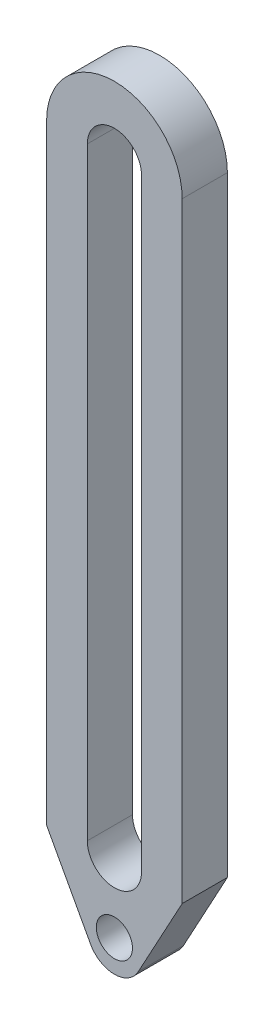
from build123d import *

# Parameters (mm, degrees)
SKETCH1_R           = 2
BOSS_EXTRUDE1_DEPTH = 5


with BuildPart() as part:
    # Sketch1 → Boss-Extrude1 (new body)
    with BuildSketch(Plane.XY):
        with BuildLine():
            Line((-1.59802711, -9.657480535), (-1.59802711, 57.875713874))
            ThreePointArc((-1.59802711, 57.875713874), (-9.09802711, 65.375713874), (-16.59802711, 57.875713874))
            Line((-16.59802711, 57.875713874), (-16.59802711, -9.657480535))
            Line((-16.59802711, -9.657480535), (-11.734619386, -18.616866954))
            ThreePointArc((-11.734619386, -18.616866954), (-9.09802711, -20.18565028), (-6.461434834, -18.616866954))
            Line((-6.461434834, -18.616866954), (-1.59802711, -9.657480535))
        make_face()
        with Locations((-9.09802711, -16.68565028)):
            Circle(SKETCH1_R, mode=Mode.SUBTRACT)
        with BuildLine():
            Line((-6.09802711, -8.893371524), (-6.09802711, 57.875713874))
            ThreePointArc((-6.09802711, 57.875713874), (-9.09802711, 60.875713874), (-12.09802711, 57.875713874))
            Line((-12.09802711, 57.875713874), (-12.09802711, -8.893371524))
            ThreePointArc((-12.09802711, -8.893371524), (-9.09802711, -11.893371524), (-6.09802711, -8.893371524))
        make_face(mode=Mode.SUBTRACT)
    extrude(amount=BOSS_EXTRUDE1_DEPTH)


solid = part.part
